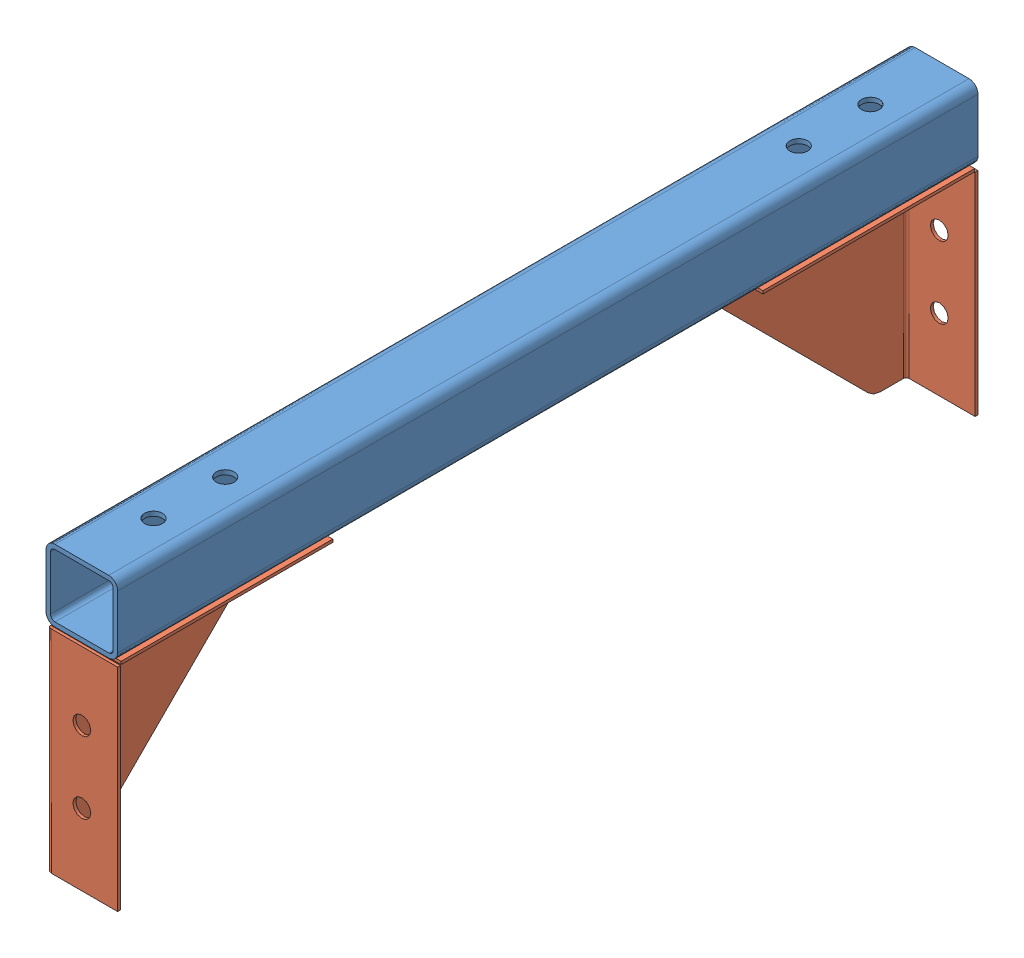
SolidWorks assembly Lower_Brace.SLDASM, configuration Default (file format 14000). Lengths in mm.
Overall size (25.4 101.6 304.8).
3 component instances, 2 part files, 2 mates.
Components (placement in the parent):
- Brace_Cross_Bar-1: Brace_Cross_Bar.SLDPRT [Plain] at (0 -27.3812 0) size (25.4 25.4 304.8)
- Brace_Corner-1: Brace_Corner.SLDPRT [Default] at (-12.7 -40.0812 152.4) x (0 0 -1) z (1 0 0) size (76.2 76.2 25.4)
- Brace_Corner-2: Brace_Corner.SLDPRT [Default] at (-12.7 -40.0812 -152.4) x (0 -1 0) z (1 0 0) size (76.2 76.2 25.4)
Mates (geometry in assembly coordinates):
- Coincident1: coincident anti-aligned: plane of Brace_Cross_Bar-1 through (12.7 -40.0812 152.4) normal (0 -1 0); plane of Brace_Corner-1 through (12.7 -40.0812 76.2) normal (0 1 0)
- Coincident2: coincident anti-aligned: plane of Brace_Cross_Bar-1 through (12.7 -40.0812 152.4) normal (0 -1 0); plane of Brace_Corner-2 through (12.7 -40.0812 -533.4) normal (0 1 0)
